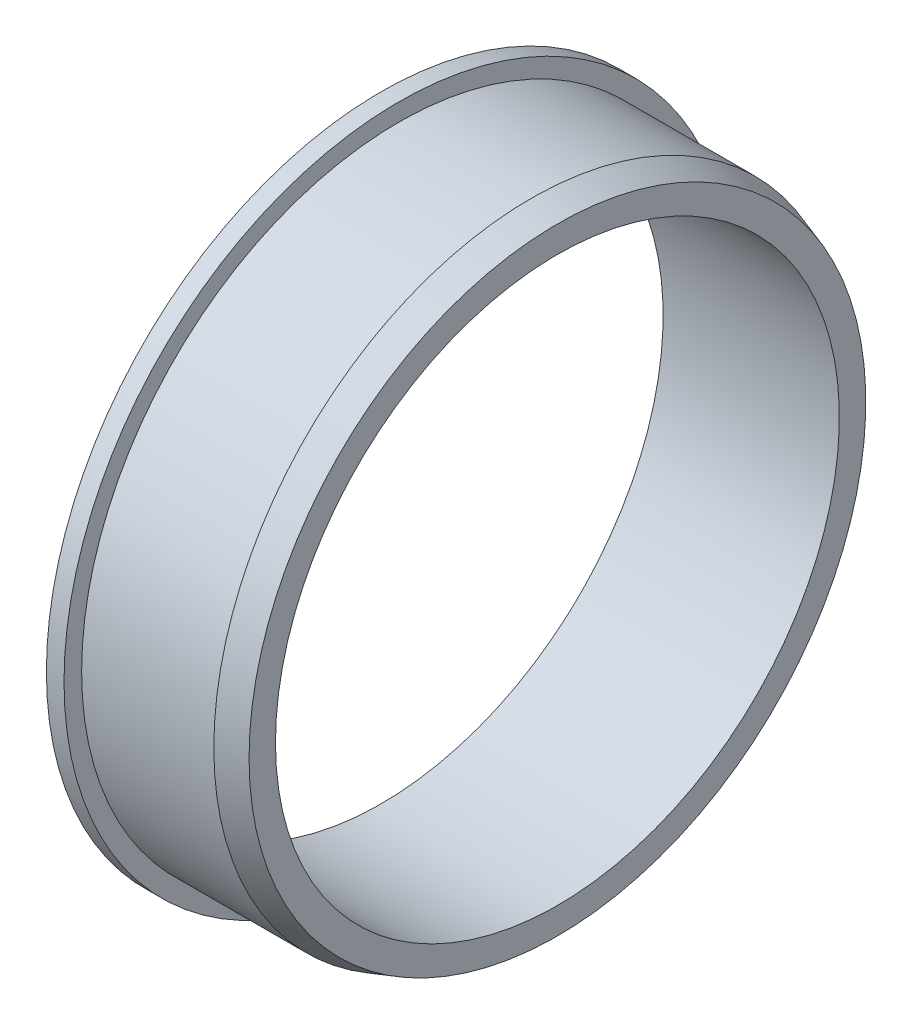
from build123d import *


with BuildPart() as part:
    # Esquisse1 → Base-R_volution (revolve)
    with BuildSketch(Plane.XY, mode=Mode.PRIVATE) as base_r_volution_sk:
        Polygon((0, 8), (0, 9.5), (0.5, 9.5), (0.5, 9), (4.25, 9), (5, 8.75), (5, 8), align=None)
    revolve(base_r_volution_sk.sketch.rotate(Axis((-0.95, 0, 0), (1, 0, 0)), 90), axis=Axis((-0.95, 0, 0), (1, 0, 0)))


solid = part.part
